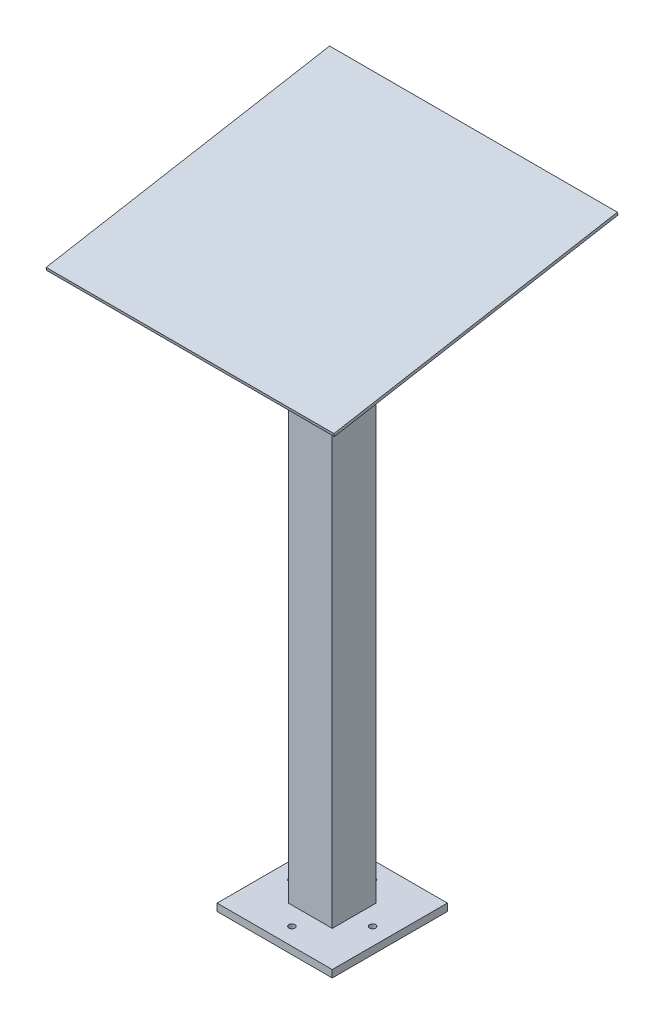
ISO-10303-21;
HEADER;
FILE_DESCRIPTION(('STEP AP214'),'2;1');
FILE_NAME('part.step','',(''),(''),'','','');
FILE_SCHEMA(('AUTOMOTIVE_DESIGN { 1 0 10303 214 1 1 1 1 }'));
ENDSEC;
DATA;
#1=APPLICATION_CONTEXT('core data for automotive mechanical design processes');
#2=APPLICATION_PROTOCOL_DEFINITION('international standard','automotive_design',2000,#1);
#3=PRODUCT_CONTEXT('',#1,'mechanical');
#4=PRODUCT('Part','Part','',(#3));
#5=PRODUCT_RELATED_PRODUCT_CATEGORY('part','',(#4));
#6=PRODUCT_DEFINITION_FORMATION('','',#4);
#7=PRODUCT_DEFINITION_CONTEXT('part definition',#1,'design');
#8=PRODUCT_DEFINITION('design','',#6,#7);
#9=PRODUCT_DEFINITION_SHAPE('','',#8);
#10=(LENGTH_UNIT() NAMED_UNIT(*) SI_UNIT(.MILLI.,.METRE.));
#11=(NAMED_UNIT(*) PLANE_ANGLE_UNIT() SI_UNIT($,.RADIAN.));
#12=(NAMED_UNIT(*) SI_UNIT($,.STERADIAN.) SOLID_ANGLE_UNIT());
#13=UNCERTAINTY_MEASURE_WITH_UNIT(LENGTH_MEASURE(1.E-05),#10,'distance_accuracy_value','');
#14=(GEOMETRIC_REPRESENTATION_CONTEXT(3) GLOBAL_UNCERTAINTY_ASSIGNED_CONTEXT((#13)) GLOBAL_UNIT_ASSIGNED_CONTEXT((#10,
#11,#12)) REPRESENTATION_CONTEXT('',''));
#15=CARTESIAN_POINT('',(0.,0.,0.));
#16=DIRECTION('',(0.,0.,1.));
#17=DIRECTION('',(1.,0.,0.));
#18=AXIS2_PLACEMENT_3D('',#15,#16,#17);
#19=CARTESIAN_POINT('',(-2.19979327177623E-13,967.493936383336,247.070179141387));
#20=DIRECTION('',(0.,0.173648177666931,-0.984807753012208));
#21=DIRECTION('',(0.,0.984807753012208,0.173648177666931));
#22=AXIS2_PLACEMENT_3D('',#19,#20,#21);
#23=PLANE('',#22);
#24=DIRECTION('',(1.,0.,0.));
#25=VECTOR('',#24,1.);
#26=CARTESIAN_POINT('',(-2.19979327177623E-13,962.569897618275,246.201938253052));
#27=LINE('',#26,#25);
#28=CARTESIAN_POINT('',(-250.,962.569897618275,246.201938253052));
#29=VERTEX_POINT('',#28);
#30=CARTESIAN_POINT('',(250.,962.569897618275,246.201938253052));
#31=VERTEX_POINT('',#30);
#32=EDGE_CURVE('E106',#29,#31,#27,.T.);
#33=ORIENTED_EDGE('',*,*,#32,.T.);
#34=DIRECTION('',(0.,-0.984807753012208,-0.173648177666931));
#35=VECTOR('',#34,1.);
#36=CARTESIAN_POINT('',(250.,967.493936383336,247.070179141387));
#37=LINE('',#36,#35);
#38=CARTESIAN_POINT('',(250.,967.493936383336,247.070179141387));
#39=VERTEX_POINT('',#38);
#40=EDGE_CURVE('E12',#39,#31,#37,.T.);
#41=ORIENTED_EDGE('',*,*,#40,.F.);
#42=DIRECTION('',(1.,0.,0.));
#43=VECTOR('',#42,1.);
#44=CARTESIAN_POINT('',(-2.19979327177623E-13,967.493936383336,247.070179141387));
#45=LINE('',#44,#43);
#46=CARTESIAN_POINT('',(-250.,967.493936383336,247.070179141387));
#47=VERTEX_POINT('',#46);
#48=EDGE_CURVE('E83',#47,#39,#45,.T.);
#49=ORIENTED_EDGE('',*,*,#48,.F.);
#50=DIRECTION('',(0.,-0.984807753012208,-0.173648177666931));
#51=VECTOR('',#50,1.);
#52=CARTESIAN_POINT('',(-250.,967.493936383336,247.070179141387));
#53=LINE('',#52,#51);
#54=EDGE_CURVE('E102',#47,#29,#53,.T.);
#55=ORIENTED_EDGE('',*,*,#54,.T.);
#56=EDGE_LOOP('',(#33,#41,#49,#55));
#57=FACE_BOUND('',#56,.T.);
#58=ADVANCED_FACE('F44',(#57),#23,.F.);
#59=CARTESIAN_POINT('',(250.,980.571913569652,172.901284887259));
#60=DIRECTION('',(1.,0.,0.));
#61=DIRECTION('',(0.,0.,-1.));
#62=AXIS2_PLACEMENT_3D('',#59,#60,#61);
#63=PLANE('',#62);
#64=DIRECTION('',(0.,-0.173648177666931,0.984807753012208));
#65=VECTOR('',#64,1.);
#66=CARTESIAN_POINT('',(250.,975.647874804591,172.033043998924));
#67=LINE('',#66,#65);
#68=CARTESIAN_POINT('',(250.,1049.39398645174,-246.201938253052));
#69=VERTEX_POINT('',#68);
#70=EDGE_CURVE('E92',#69,#31,#67,.T.);
#71=ORIENTED_EDGE('',*,*,#70,.F.);
#72=DIRECTION('',(0.,-0.984807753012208,-0.173648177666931));
#73=VECTOR('',#72,1.);
#74=CARTESIAN_POINT('',(250.,1054.3180252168,-245.333697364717));
#75=LINE('',#74,#73);
#76=CARTESIAN_POINT('',(250.,1054.3180252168,-245.333697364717));
#77=VERTEX_POINT('',#76);
#78=EDGE_CURVE('E52',#77,#69,#75,.T.);
#79=ORIENTED_EDGE('',*,*,#78,.F.);
#80=DIRECTION('',(0.,-0.173648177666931,0.984807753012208));
#81=VECTOR('',#80,1.);
#82=CARTESIAN_POINT('',(250.,980.571913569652,172.901284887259));
#83=LINE('',#82,#81);
#84=EDGE_CURVE('E90',#77,#39,#83,.T.);
#85=ORIENTED_EDGE('',*,*,#84,.T.);
#86=ORIENTED_EDGE('',*,*,#40,.T.);
#87=EDGE_LOOP('',(#71,#79,#85,#86));
#88=FACE_BOUND('',#87,.T.);
#89=ADVANCED_FACE('F89',(#88),#63,.T.);
#90=CARTESIAN_POINT('',(-2.19979327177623E-13,1054.3180252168,-245.333697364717));
#91=DIRECTION('',(0.,0.173648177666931,-0.984807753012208));
#92=DIRECTION('',(0.,0.984807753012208,0.173648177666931));
#93=AXIS2_PLACEMENT_3D('',#90,#91,#92);
#94=PLANE('',#93);
#95=DIRECTION('',(1.,0.,0.));
#96=VECTOR('',#95,1.);
#97=CARTESIAN_POINT('',(-2.19979327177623E-13,1049.39398645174,-246.201938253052));
#98=LINE('',#97,#96);
#99=CARTESIAN_POINT('',(-250.,1049.39398645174,-246.201938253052));
#100=VERTEX_POINT('',#99);
#101=EDGE_CURVE('E110',#100,#69,#98,.T.);
#102=ORIENTED_EDGE('',*,*,#101,.F.);
#103=DIRECTION('',(0.,-0.984807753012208,-0.173648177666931));
#104=VECTOR('',#103,1.);
#105=CARTESIAN_POINT('',(-250.,1054.3180252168,-245.333697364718));
#106=LINE('',#105,#104);
#107=CARTESIAN_POINT('',(-250.,1054.3180252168,-245.333697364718));
#108=VERTEX_POINT('',#107);
#109=EDGE_CURVE('E75',#108,#100,#106,.T.);
#110=ORIENTED_EDGE('',*,*,#109,.F.);
#111=DIRECTION('',(1.,0.,0.));
#112=VECTOR('',#111,1.);
#113=CARTESIAN_POINT('',(-2.19979327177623E-13,1054.3180252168,-245.333697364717));
#114=LINE('',#113,#112);
#115=EDGE_CURVE('E98',#108,#77,#114,.T.);
#116=ORIENTED_EDGE('',*,*,#115,.T.);
#117=ORIENTED_EDGE('',*,*,#78,.T.);
#118=EDGE_LOOP('',(#102,#110,#116,#117));
#119=FACE_BOUND('',#118,.T.);
#120=ADVANCED_FACE('F100',(#119),#94,.T.);
#121=CARTESIAN_POINT('',(-250.,980.571913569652,172.901284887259));
#122=DIRECTION('',(1.,0.,0.));
#123=DIRECTION('',(0.,0.,-1.));
#124=AXIS2_PLACEMENT_3D('',#121,#122,#123);
#125=PLANE('',#124);
#126=DIRECTION('',(0.,-0.173648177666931,0.984807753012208));
#127=VECTOR('',#126,1.);
#128=CARTESIAN_POINT('',(-250.,975.647874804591,172.033043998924));
#129=LINE('',#128,#127);
#130=EDGE_CURVE('E78',#100,#29,#129,.T.);
#131=ORIENTED_EDGE('',*,*,#130,.T.);
#132=ORIENTED_EDGE('',*,*,#54,.F.);
#133=DIRECTION('',(0.,-0.173648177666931,0.984807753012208));
#134=VECTOR('',#133,1.);
#135=CARTESIAN_POINT('',(-250.,980.571913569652,172.901284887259));
#136=LINE('',#135,#134);
#137=EDGE_CURVE('E60',#108,#47,#136,.T.);
#138=ORIENTED_EDGE('',*,*,#137,.F.);
#139=ORIENTED_EDGE('',*,*,#109,.T.);
#140=EDGE_LOOP('',(#131,#132,#138,#139));
#141=FACE_BOUND('',#140,.T.);
#142=ADVANCED_FACE('F123',(#141),#125,.F.);
#143=CARTESIAN_POINT('',(-2.19979327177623E-13,980.571913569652,172.901284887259));
#144=DIRECTION('',(0.,0.984807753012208,0.173648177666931));
#145=DIRECTION('',(0.,-0.173648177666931,0.984807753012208));
#146=AXIS2_PLACEMENT_3D('',#143,#144,#145);
#147=PLANE('',#146);
#148=ORIENTED_EDGE('',*,*,#48,.T.);
#149=ORIENTED_EDGE('',*,*,#84,.F.);
#150=ORIENTED_EDGE('',*,*,#115,.F.);
#151=ORIENTED_EDGE('',*,*,#137,.T.);
#152=EDGE_LOOP('',(#148,#149,#150,#151));
#153=FACE_BOUND('',#152,.T.);
#154=ADVANCED_FACE('F97',(#153),#147,.T.);
#155=CARTESIAN_POINT('',(-2.19979327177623E-13,975.647874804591,172.033043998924));
#156=DIRECTION('',(0.,0.984807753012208,0.173648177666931));
#157=DIRECTION('',(0.,-0.173648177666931,0.984807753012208));
#158=AXIS2_PLACEMENT_3D('',#155,#156,#157);
#159=PLANE('',#158);
#160=ORIENTED_EDGE('',*,*,#32,.F.);
#161=ORIENTED_EDGE('',*,*,#130,.F.);
#162=ORIENTED_EDGE('',*,*,#101,.T.);
#163=ORIENTED_EDGE('',*,*,#70,.T.);
#164=EDGE_LOOP('',(#160,#161,#162,#163));
#165=FACE_BOUND('',#164,.T.);
#166=ADVANCED_FACE('F117',(#165),#159,.F.);
#167=CLOSED_SHELL('',(#58,#89,#120,#142,#154,#166));
#168=MANIFOLD_SOLID_BREP('B2',#167);
#169=CARTESIAN_POINT('',(0.,12.7,0.));
#170=DIRECTION('',(0.,1.,0.));
#171=DIRECTION('',(0.,0.,1.));
#172=AXIS2_PLACEMENT_3D('',#169,#170,#171);
#173=PLANE('',#172);
#174=DIRECTION('',(0.,0.,1.));
#175=VECTOR('',#174,1.);
#176=CARTESIAN_POINT('',(38.1,12.7,0.));
#177=LINE('',#176,#175);
#178=CARTESIAN_POINT('',(38.1,12.7,-38.1));
#179=VERTEX_POINT('',#178);
#180=CARTESIAN_POINT('',(38.1,12.7,38.1));
#181=VERTEX_POINT('',#180);
#182=EDGE_CURVE('E472',#179,#181,#177,.T.);
#183=ORIENTED_EDGE('',*,*,#182,.T.);
#184=DIRECTION('',(1.,0.,0.));
#185=VECTOR('',#184,1.);
#186=CARTESIAN_POINT('',(0.,12.7,38.1));
#187=LINE('',#186,#185);
#188=CARTESIAN_POINT('',(-38.1,12.7,38.1));
#189=VERTEX_POINT('',#188);
#190=EDGE_CURVE('E258',#189,#181,#187,.T.);
#191=ORIENTED_EDGE('',*,*,#190,.F.);
#192=DIRECTION('',(0.,0.,1.));
#193=VECTOR('',#192,1.);
#194=CARTESIAN_POINT('',(-38.1,12.7,0.));
#195=LINE('',#194,#193);
#196=CARTESIAN_POINT('',(-38.1,12.7,-38.1));
#197=VERTEX_POINT('',#196);
#198=EDGE_CURVE('E469',#197,#189,#195,.T.);
#199=ORIENTED_EDGE('',*,*,#198,.F.);
#200=DIRECTION('',(1.,0.,0.));
#201=VECTOR('',#200,1.);
#202=CARTESIAN_POINT('',(0.,12.7,-38.1));
#203=LINE('',#202,#201);
#204=EDGE_CURVE('E268',#197,#179,#203,.T.);
#205=ORIENTED_EDGE('',*,*,#204,.T.);
#206=EDGE_LOOP('',(#183,#191,#199,#205));
#207=FACE_BOUND('',#206,.T.);
#208=CARTESIAN_POINT('',(0.,12.7,69.999999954));
#209=DIRECTION('',(0.,1.,0.));
#210=DIRECTION('',(0.,0.,1.));
#211=AXIS2_PLACEMENT_3D('',#208,#209,#210);
#212=CIRCLE('',#211,5.25);
#213=CARTESIAN_POINT('',(0.,12.7,75.249999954));
#214=VERTEX_POINT('',#213);
#215=EDGE_CURVE('E283',#214,#214,#212,.T.);
#216=ORIENTED_EDGE('',*,*,#215,.F.);
#217=EDGE_LOOP('',(#216));
#218=FACE_BOUND('',#217,.T.);
#219=CARTESIAN_POINT('',(0.,12.7,-69.999999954));
#220=DIRECTION('',(0.,1.,0.));
#221=DIRECTION('',(0.,0.,1.));
#222=AXIS2_PLACEMENT_3D('',#219,#220,#221);
#223=CIRCLE('',#222,5.25);
#224=CARTESIAN_POINT('',(0.,12.7,-64.749999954));
#225=VERTEX_POINT('',#224);
#226=EDGE_CURVE('E295',#225,#225,#223,.T.);
#227=ORIENTED_EDGE('',*,*,#226,.F.);
#228=EDGE_LOOP('',(#227));
#229=FACE_BOUND('',#228,.T.);
#230=DIRECTION('',(0.,0.,1.));
#231=VECTOR('',#230,1.);
#232=CARTESIAN_POINT('',(-100.,12.7,-100.));
#233=LINE('',#232,#231);
#234=CARTESIAN_POINT('',(-100.,12.7,-100.));
#235=VERTEX_POINT('',#234);
#236=CARTESIAN_POINT('',(-100.,12.7,100.));
#237=VERTEX_POINT('',#236);
#238=EDGE_CURVE('E301',#235,#237,#233,.T.);
#239=ORIENTED_EDGE('',*,*,#238,.T.);
#240=DIRECTION('',(1.,0.,0.));
#241=VECTOR('',#240,1.);
#242=CARTESIAN_POINT('',(-100.,12.7,100.));
#243=LINE('',#242,#241);
#244=CARTESIAN_POINT('',(100.,12.7,100.));
#245=VERTEX_POINT('',#244);
#246=EDGE_CURVE('E225',#237,#245,#243,.T.);
#247=ORIENTED_EDGE('',*,*,#246,.T.);
#248=DIRECTION('',(0.,0.,-1.));
#249=VECTOR('',#248,1.);
#250=CARTESIAN_POINT('',(100.,12.7,-100.));
#251=LINE('',#250,#249);
#252=CARTESIAN_POINT('',(100.,12.7,-100.));
#253=VERTEX_POINT('',#252);
#254=EDGE_CURVE('E304',#245,#253,#251,.T.);
#255=ORIENTED_EDGE('',*,*,#254,.T.);
#256=DIRECTION('',(-1.,0.,0.));
#257=VECTOR('',#256,1.);
#258=CARTESIAN_POINT('',(-100.,12.7,-100.));
#259=LINE('',#258,#257);
#260=EDGE_CURVE('E197',#253,#235,#259,.T.);
#261=ORIENTED_EDGE('',*,*,#260,.T.);
#262=EDGE_LOOP('',(#239,#247,#255,#261));
#263=FACE_BOUND('',#262,.T.);
#264=CARTESIAN_POINT('',(69.999999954,12.7,0.));
#265=DIRECTION('',(0.,1.,0.));
#266=DIRECTION('',(0.,0.,1.));
#267=AXIS2_PLACEMENT_3D('',#264,#265,#266);
#268=CIRCLE('',#267,5.25);
#269=CARTESIAN_POINT('',(69.999999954,12.7,5.25));
#270=VERTEX_POINT('',#269);
#271=EDGE_CURVE('E289',#270,#270,#268,.T.);
#272=ORIENTED_EDGE('',*,*,#271,.F.);
#273=EDGE_LOOP('',(#272));
#274=FACE_BOUND('',#273,.T.);
#275=CARTESIAN_POINT('',(-69.999999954,12.7,0.));
#276=DIRECTION('',(0.,1.,0.));
#277=DIRECTION('',(0.,0.,1.));
#278=AXIS2_PLACEMENT_3D('',#275,#276,#277);
#279=CIRCLE('',#278,5.25);
#280=CARTESIAN_POINT('',(-69.999999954,12.7,5.25));
#281=VERTEX_POINT('',#280);
#282=EDGE_CURVE('E277',#281,#281,#279,.T.);
#283=ORIENTED_EDGE('',*,*,#282,.F.);
#284=EDGE_LOOP('',(#283));
#285=FACE_BOUND('',#284,.T.);
#286=ADVANCED_FACE('F173',(#207,#218,#229,#263,#274,#285),#173,.T.);
#287=CARTESIAN_POINT('',(0.,0.,0.));
#288=DIRECTION('',(0.,1.,0.));
#289=DIRECTION('',(0.,0.,1.));
#290=AXIS2_PLACEMENT_3D('',#287,#288,#289);
#291=PLANE('',#290);
#292=DIRECTION('',(0.,0.,1.));
#293=VECTOR('',#292,1.);
#294=CARTESIAN_POINT('',(-100.,0.,-100.));
#295=LINE('',#294,#293);
#296=CARTESIAN_POINT('',(-100.,0.,-100.));
#297=VERTEX_POINT('',#296);
#298=CARTESIAN_POINT('',(-100.,0.,100.));
#299=VERTEX_POINT('',#298);
#300=EDGE_CURVE('E298',#297,#299,#295,.T.);
#301=ORIENTED_EDGE('',*,*,#300,.F.);
#302=DIRECTION('',(-1.,0.,0.));
#303=VECTOR('',#302,1.);
#304=CARTESIAN_POINT('',(-100.,0.,-100.));
#305=LINE('',#304,#303);
#306=CARTESIAN_POINT('',(100.,0.,-100.));
#307=VERTEX_POINT('',#306);
#308=EDGE_CURVE('E218',#307,#297,#305,.T.);
#309=ORIENTED_EDGE('',*,*,#308,.F.);
#310=DIRECTION('',(0.,0.,-1.));
#311=VECTOR('',#310,1.);
#312=CARTESIAN_POINT('',(100.,0.,-100.));
#313=LINE('',#312,#311);
#314=CARTESIAN_POINT('',(100.,0.,100.));
#315=VERTEX_POINT('',#314);
#316=EDGE_CURVE('E312',#315,#307,#313,.T.);
#317=ORIENTED_EDGE('',*,*,#316,.F.);
#318=DIRECTION('',(1.,0.,0.));
#319=VECTOR('',#318,1.);
#320=CARTESIAN_POINT('',(-100.,0.,100.));
#321=LINE('',#320,#319);
#322=EDGE_CURVE('E310',#299,#315,#321,.T.);
#323=ORIENTED_EDGE('',*,*,#322,.F.);
#324=EDGE_LOOP('',(#301,#309,#317,#323));
#325=FACE_BOUND('',#324,.T.);
#326=CARTESIAN_POINT('',(0.,0.,-69.999999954));
#327=DIRECTION('',(0.,1.,0.));
#328=DIRECTION('',(0.,0.,1.));
#329=AXIS2_PLACEMENT_3D('',#326,#327,#328);
#330=CIRCLE('',#329,5.25);
#331=CARTESIAN_POINT('',(0.,0.,-64.749999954));
#332=VERTEX_POINT('',#331);
#333=EDGE_CURVE('E292',#332,#332,#330,.T.);
#334=ORIENTED_EDGE('',*,*,#333,.T.);
#335=EDGE_LOOP('',(#334));
#336=FACE_BOUND('',#335,.T.);
#337=CARTESIAN_POINT('',(69.999999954,0.,0.));
#338=DIRECTION('',(0.,1.,0.));
#339=DIRECTION('',(0.,0.,1.));
#340=AXIS2_PLACEMENT_3D('',#337,#338,#339);
#341=CIRCLE('',#340,5.25);
#342=CARTESIAN_POINT('',(69.999999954,0.,5.25));
#343=VERTEX_POINT('',#342);
#344=EDGE_CURVE('E286',#343,#343,#341,.T.);
#345=ORIENTED_EDGE('',*,*,#344,.T.);
#346=EDGE_LOOP('',(#345));
#347=FACE_BOUND('',#346,.T.);
#348=CARTESIAN_POINT('',(0.,0.,69.999999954));
#349=DIRECTION('',(0.,1.,0.));
#350=DIRECTION('',(0.,0.,1.));
#351=AXIS2_PLACEMENT_3D('',#348,#349,#350);
#352=CIRCLE('',#351,5.25);
#353=CARTESIAN_POINT('',(0.,0.,75.249999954));
#354=VERTEX_POINT('',#353);
#355=EDGE_CURVE('E280',#354,#354,#352,.T.);
#356=ORIENTED_EDGE('',*,*,#355,.T.);
#357=EDGE_LOOP('',(#356));
#358=FACE_BOUND('',#357,.T.);
#359=CARTESIAN_POINT('',(-69.999999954,0.,0.));
#360=DIRECTION('',(0.,1.,0.));
#361=DIRECTION('',(0.,0.,1.));
#362=AXIS2_PLACEMENT_3D('',#359,#360,#361);
#363=CIRCLE('',#362,5.25);
#364=CARTESIAN_POINT('',(-69.999999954,0.,5.25));
#365=VERTEX_POINT('',#364);
#366=EDGE_CURVE('E272',#365,#365,#363,.T.);
#367=ORIENTED_EDGE('',*,*,#366,.T.);
#368=EDGE_LOOP('',(#367));
#369=FACE_BOUND('',#368,.T.);
#370=ADVANCED_FACE('F325',(#325,#336,#347,#358,#369),#291,.F.);
#371=CARTESIAN_POINT('',(-100.,12.7,-100.));
#372=DIRECTION('',(1.,0.,0.));
#373=DIRECTION('',(0.,0.,-1.));
#374=AXIS2_PLACEMENT_3D('',#371,#372,#373);
#375=PLANE('',#374);
#376=ORIENTED_EDGE('',*,*,#300,.T.);
#377=DIRECTION('',(0.,-1.,0.));
#378=VECTOR('',#377,1.);
#379=CARTESIAN_POINT('',(-100.,12.7,100.));
#380=LINE('',#379,#378);
#381=EDGE_CURVE('E42',#237,#299,#380,.T.);
#382=ORIENTED_EDGE('',*,*,#381,.F.);
#383=ORIENTED_EDGE('',*,*,#238,.F.);
#384=DIRECTION('',(0.,-1.,0.));
#385=VECTOR('',#384,1.);
#386=CARTESIAN_POINT('',(-100.,12.7,-100.));
#387=LINE('',#386,#385);
#388=EDGE_CURVE('E307',#235,#297,#387,.T.);
#389=ORIENTED_EDGE('',*,*,#388,.T.);
#390=EDGE_LOOP('',(#376,#382,#383,#389));
#391=FACE_BOUND('',#390,.T.);
#392=ADVANCED_FACE('F175',(#391),#375,.F.);
#393=CARTESIAN_POINT('',(-100.,12.7,100.));
#394=DIRECTION('',(0.,0.,-1.));
#395=DIRECTION('',(-1.,0.,0.));
#396=AXIS2_PLACEMENT_3D('',#393,#394,#395);
#397=PLANE('',#396);
#398=ORIENTED_EDGE('',*,*,#322,.T.);
#399=DIRECTION('',(0.,-1.,0.));
#400=VECTOR('',#399,1.);
#401=CARTESIAN_POINT('',(100.,12.7,100.));
#402=LINE('',#401,#400);
#403=EDGE_CURVE('E181',#245,#315,#402,.T.);
#404=ORIENTED_EDGE('',*,*,#403,.F.);
#405=ORIENTED_EDGE('',*,*,#246,.F.);
#406=ORIENTED_EDGE('',*,*,#381,.T.);
#407=EDGE_LOOP('',(#398,#404,#405,#406));
#408=FACE_BOUND('',#407,.T.);
#409=ADVANCED_FACE('F341',(#408),#397,.F.);
#410=CARTESIAN_POINT('',(100.,12.7,-100.));
#411=DIRECTION('',(-1.,0.,0.));
#412=DIRECTION('',(0.,0.,1.));
#413=AXIS2_PLACEMENT_3D('',#410,#411,#412);
#414=PLANE('',#413);
#415=ORIENTED_EDGE('',*,*,#316,.T.);
#416=DIRECTION('',(0.,-1.,0.));
#417=VECTOR('',#416,1.);
#418=CARTESIAN_POINT('',(100.,12.7,-100.));
#419=LINE('',#418,#417);
#420=EDGE_CURVE('E316',#253,#307,#419,.T.);
#421=ORIENTED_EDGE('',*,*,#420,.F.);
#422=ORIENTED_EDGE('',*,*,#254,.F.);
#423=ORIENTED_EDGE('',*,*,#403,.T.);
#424=EDGE_LOOP('',(#415,#421,#422,#423));
#425=FACE_BOUND('',#424,.T.);
#426=ADVANCED_FACE('F321',(#425),#414,.F.);
#427=CARTESIAN_POINT('',(-100.,12.7,-100.));
#428=DIRECTION('',(0.,0.,1.));
#429=DIRECTION('',(1.,0.,0.));
#430=AXIS2_PLACEMENT_3D('',#427,#428,#429);
#431=PLANE('',#430);
#432=ORIENTED_EDGE('',*,*,#308,.T.);
#433=ORIENTED_EDGE('',*,*,#388,.F.);
#434=ORIENTED_EDGE('',*,*,#260,.F.);
#435=ORIENTED_EDGE('',*,*,#420,.T.);
#436=EDGE_LOOP('',(#432,#433,#434,#435));
#437=FACE_BOUND('',#436,.T.);
#438=ADVANCED_FACE('F330',(#437),#431,.F.);
#439=CARTESIAN_POINT('',(0.,12.7,-69.999999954));
#440=DIRECTION('',(0.,-1.,0.));
#441=DIRECTION('',(0.,0.,-1.));
#442=AXIS2_PLACEMENT_3D('',#439,#440,#441);
#443=CYLINDRICAL_SURFACE('',#442,5.25);
#444=ORIENTED_EDGE('',*,*,#226,.T.);
#445=EDGE_LOOP('',(#444));
#446=FACE_BOUND('',#445,.T.);
#447=ORIENTED_EDGE('',*,*,#333,.F.);
#448=EDGE_LOOP('',(#447));
#449=FACE_BOUND('',#448,.T.);
#450=ADVANCED_FACE('F332',(#446,#449),#443,.F.);
#451=CARTESIAN_POINT('',(69.999999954,12.7,0.));
#452=DIRECTION('',(0.,-1.,0.));
#453=DIRECTION('',(0.,0.,-1.));
#454=AXIS2_PLACEMENT_3D('',#451,#452,#453);
#455=CYLINDRICAL_SURFACE('',#454,5.25);
#456=ORIENTED_EDGE('',*,*,#271,.T.);
#457=EDGE_LOOP('',(#456));
#458=FACE_BOUND('',#457,.T.);
#459=ORIENTED_EDGE('',*,*,#344,.F.);
#460=EDGE_LOOP('',(#459));
#461=FACE_BOUND('',#460,.T.);
#462=ADVANCED_FACE('F338',(#458,#461),#455,.F.);
#463=CARTESIAN_POINT('',(0.,12.7,69.999999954));
#464=DIRECTION('',(0.,-1.,0.));
#465=DIRECTION('',(0.,0.,-1.));
#466=AXIS2_PLACEMENT_3D('',#463,#464,#465);
#467=CYLINDRICAL_SURFACE('',#466,5.25);
#468=ORIENTED_EDGE('',*,*,#215,.T.);
#469=EDGE_LOOP('',(#468));
#470=FACE_BOUND('',#469,.T.);
#471=ORIENTED_EDGE('',*,*,#355,.F.);
#472=EDGE_LOOP('',(#471));
#473=FACE_BOUND('',#472,.T.);
#474=ADVANCED_FACE('F355',(#470,#473),#467,.F.);
#475=CARTESIAN_POINT('',(-69.999999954,12.7,0.));
#476=DIRECTION('',(0.,-1.,0.));
#477=DIRECTION('',(0.,0.,-1.));
#478=AXIS2_PLACEMENT_3D('',#475,#476,#477);
#479=CYLINDRICAL_SURFACE('',#478,5.25);
#480=ORIENTED_EDGE('',*,*,#282,.T.);
#481=EDGE_LOOP('',(#480));
#482=FACE_BOUND('',#481,.T.);
#483=ORIENTED_EDGE('',*,*,#366,.F.);
#484=EDGE_LOOP('',(#483));
#485=FACE_BOUND('',#484,.T.);
#486=ADVANCED_FACE('F359',(#482,#485),#479,.F.);
#487=CARTESIAN_POINT('',(38.1,1012.7,0.));
#488=DIRECTION('',(1.,0.,0.));
#489=DIRECTION('',(0.,0.,-1.));
#490=AXIS2_PLACEMENT_3D('',#487,#488,#489);
#491=PLANE('',#490);
#492=DIRECTION('',(0.,0.173648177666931,-0.984807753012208));
#493=VECTOR('',#492,1.);
#494=CARTESIAN_POINT('',(38.1,1006.18451626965,-1.14885557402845));
#495=LINE('',#494,#493);
#496=CARTESIAN_POINT('',(38.1,999.263884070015,38.1));
#497=VERTEX_POINT('',#496);
#498=CARTESIAN_POINT('',(38.1,1012.7,-38.1));
#499=VERTEX_POINT('',#498);
#500=EDGE_CURVE('E253',#497,#499,#495,.T.);
#501=ORIENTED_EDGE('',*,*,#500,.F.);
#502=DIRECTION('',(0.,-1.,0.));
#503=VECTOR('',#502,1.);
#504=CARTESIAN_POINT('',(38.1,1012.7,38.1));
#505=LINE('',#504,#503);
#506=EDGE_CURVE('E257',#497,#181,#505,.T.);
#507=ORIENTED_EDGE('',*,*,#506,.T.);
#508=ORIENTED_EDGE('',*,*,#182,.F.);
#509=DIRECTION('',(0.,-1.,0.));
#510=VECTOR('',#509,1.);
#511=CARTESIAN_POINT('',(38.1,1012.7,-38.1));
#512=LINE('',#511,#510);
#513=EDGE_CURVE('E270',#499,#179,#512,.T.);
#514=ORIENTED_EDGE('',*,*,#513,.F.);
#515=EDGE_LOOP('',(#501,#507,#508,#514));
#516=FACE_BOUND('',#515,.T.);
#517=ADVANCED_FACE('F363',(#516),#491,.T.);
#518=CARTESIAN_POINT('',(0.,1012.7,-38.1));
#519=DIRECTION('',(0.,0.,-1.));
#520=DIRECTION('',(-1.,0.,0.));
#521=AXIS2_PLACEMENT_3D('',#518,#519,#520);
#522=PLANE('',#521);
#523=ORIENTED_EDGE('',*,*,#204,.F.);
#524=DIRECTION('',(0.,-1.,0.));
#525=VECTOR('',#524,1.);
#526=CARTESIAN_POINT('',(-38.1,1012.7,-38.1));
#527=LINE('',#526,#525);
#528=CARTESIAN_POINT('',(-38.1,1012.7,-38.1));
#529=VERTEX_POINT('',#528);
#530=EDGE_CURVE('E262',#529,#197,#527,.T.);
#531=ORIENTED_EDGE('',*,*,#530,.F.);
#532=DIRECTION('',(1.,0.,0.));
#533=VECTOR('',#532,1.);
#534=CARTESIAN_POINT('',(0.,1012.7,-38.1));
#535=LINE('',#534,#533);
#536=EDGE_CURVE('E248',#529,#499,#535,.T.);
#537=ORIENTED_EDGE('',*,*,#536,.T.);
#538=ORIENTED_EDGE('',*,*,#513,.T.);
#539=EDGE_LOOP('',(#523,#531,#537,#538));
#540=FACE_BOUND('',#539,.T.);
#541=ADVANCED_FACE('F266',(#540),#522,.T.);
#542=CARTESIAN_POINT('',(-38.1,1012.7,0.));
#543=DIRECTION('',(1.,0.,0.));
#544=DIRECTION('',(0.,0.,-1.));
#545=AXIS2_PLACEMENT_3D('',#542,#543,#544);
#546=PLANE('',#545);
#547=DIRECTION('',(0.,-1.,0.));
#548=VECTOR('',#547,1.);
#549=CARTESIAN_POINT('',(-38.1,1012.7,38.1));
#550=LINE('',#549,#548);
#551=CARTESIAN_POINT('',(-38.1,999.263884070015,38.1));
#552=VERTEX_POINT('',#551);
#553=EDGE_CURVE('E188',#552,#189,#550,.T.);
#554=ORIENTED_EDGE('',*,*,#553,.F.);
#555=DIRECTION('',(0.,-0.173648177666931,0.984807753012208));
#556=VECTOR('',#555,1.);
#557=CARTESIAN_POINT('',(-38.1,1012.7,-38.1));
#558=LINE('',#557,#556);
#559=EDGE_CURVE('E251',#529,#552,#558,.T.);
#560=ORIENTED_EDGE('',*,*,#559,.F.);
#561=ORIENTED_EDGE('',*,*,#530,.T.);
#562=ORIENTED_EDGE('',*,*,#198,.T.);
#563=EDGE_LOOP('',(#554,#560,#561,#562));
#564=FACE_BOUND('',#563,.T.);
#565=ADVANCED_FACE('F261',(#564),#546,.F.);
#566=CARTESIAN_POINT('',(0.,1012.7,38.1));
#567=DIRECTION('',(0.,0.,-1.));
#568=DIRECTION('',(-1.,0.,0.));
#569=AXIS2_PLACEMENT_3D('',#566,#567,#568);
#570=PLANE('',#569);
#571=ORIENTED_EDGE('',*,*,#506,.F.);
#572=DIRECTION('',(-1.,0.,0.));
#573=VECTOR('',#572,1.);
#574=CARTESIAN_POINT('',(100.,999.263884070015,38.1));
#575=LINE('',#574,#573);
#576=EDGE_CURVE('E264',#497,#552,#575,.T.);
#577=ORIENTED_EDGE('',*,*,#576,.T.);
#578=ORIENTED_EDGE('',*,*,#553,.T.);
#579=ORIENTED_EDGE('',*,*,#190,.T.);
#580=EDGE_LOOP('',(#571,#577,#578,#579));
#581=FACE_BOUND('',#580,.T.);
#582=ADVANCED_FACE('F372',(#581),#570,.F.);
#583=CARTESIAN_POINT('',(100.,1012.7,-38.1));
#584=DIRECTION('',(0.,-0.984807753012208,-0.173648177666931));
#585=DIRECTION('',(0.,0.173648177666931,-0.984807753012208));
#586=AXIS2_PLACEMENT_3D('',#583,#584,#585);
#587=PLANE('',#586);
#588=ORIENTED_EDGE('',*,*,#500,.T.);
#589=ORIENTED_EDGE('',*,*,#536,.F.);
#590=ORIENTED_EDGE('',*,*,#559,.T.);
#591=ORIENTED_EDGE('',*,*,#576,.F.);
#592=EDGE_LOOP('',(#588,#589,#590,#591));
#593=FACE_BOUND('',#592,.T.);
#594=ADVANCED_FACE('F250',(#593),#587,.F.);
#595=CLOSED_SHELL('',(#286,#370,#392,#409,#426,#438,#450,#462,#474,#486,#517,#541,#565,#582,#594));
#596=MANIFOLD_SOLID_BREP('B6',#595);
#597=ADVANCED_BREP_SHAPE_REPRESENTATION('',(#18,#168,#596),#14);
#598=SHAPE_DEFINITION_REPRESENTATION(#9,#597);
ENDSEC;
END-ISO-10303-21;
